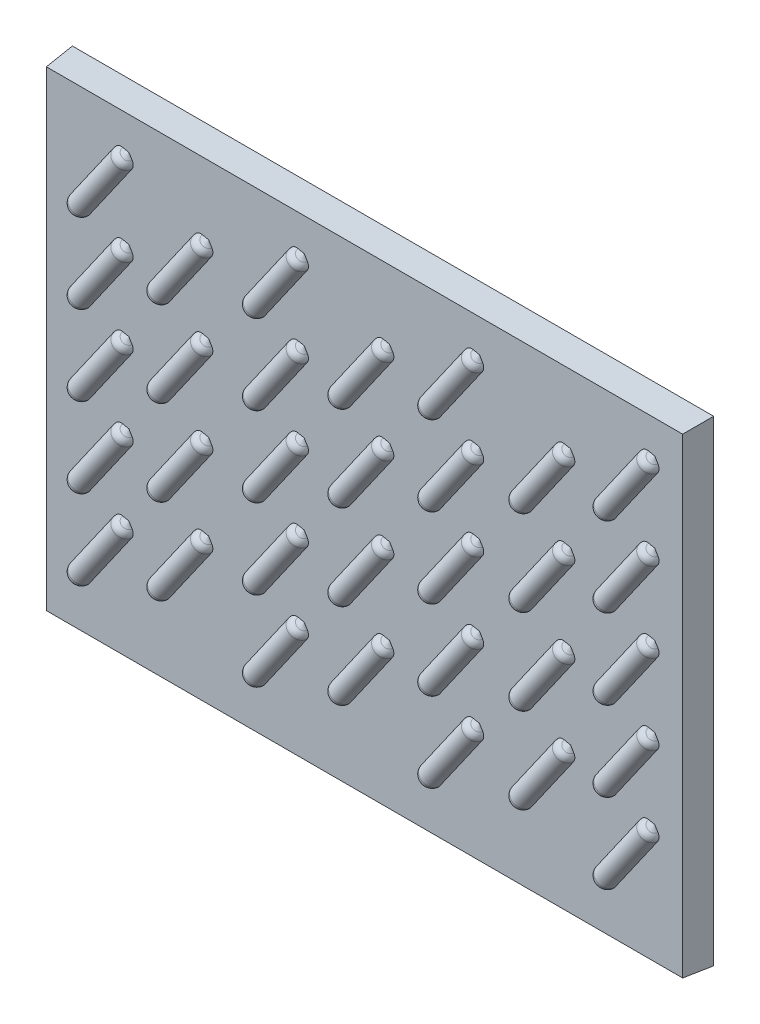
from build123d import *

# Parameters (mm, degrees)
ESQUISSE1_W                = 45
ESQUISSE1_H                = 33.4
BOSS_EXTRU_1_DEPTH         = 2
R_P_TITION_LIN_AIRE2_COUNT = 5
R_P_TITION_LIN_AIRE2_PITCH = 5.6
R_P_TITION_LIN_AIRE3_COUNT = 4
R_P_TITION_LIN_AIRE3_PITCH = 12.3
R_P_TITION_LIN_AIRE4_COUNT = 4
R_P_TITION_LIN_AIRE4_PITCH = 6
R_P_TITION_LIN_AIRE5_COUNT = 3
R_P_TITION_LIN_AIRE5_PITCH = 12.7
D_POUILLE1_ANGLE           = -5


with BuildPart() as part:
    # Esquisse1 → Boss.-Extru.1 (new body)
    with BuildSketch(Plane.XY):
        Rectangle(ESQUISSE1_W, ESQUISSE1_H)
    extrude(amount=BOSS_EXTRU_1_DEPTH)

    # Esquisse8 → R_volution4 (revolve)
    with BuildSketch(Plane(origin=(-7.251293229, 5.077410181, 0), x_dir=(0, 0, 1), z_dir=(-0.8191520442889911, 0.5735764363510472, 0))):
        with BuildLine():
            Line((2, -22.685308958), (2, -16.185308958))
            Line((2, -16.185308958), (1.603040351, -16.355434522))
            ThreePointArc((1.603040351, -16.355434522), (1.382579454, -16.539761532), (1.3, -16.815007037))
            Line((1.3, -16.815007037), (1.3, -22.055610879))
            ThreePointArc((1.3, -22.055610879), (1.382579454, -22.330856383), (1.603040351, -22.515183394))
            Line((1.603040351, -22.515183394), (2, -22.685308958))
        make_face()
    r_volution4 = revolve(axis=Axis((-20.263051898, -13.505307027, 2), (0.5735764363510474, 0.8191520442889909, 0)))

    # R_p_tition lin_aire2: R_volution4 ×5
    with Locations(*[(0, i * R_P_TITION_LIN_AIRE2_PITCH, 0) for i in range(1, R_P_TITION_LIN_AIRE2_COUNT)]):
        add(r_volution4)

    # R_p_tition lin_aire3: R_volution4 ×4
    with Locations(*[(i * R_P_TITION_LIN_AIRE3_PITCH, 0, 0) for i in range(1, R_P_TITION_LIN_AIRE3_COUNT)]):
        add(r_volution4)

    # R_p_tition lin_aire3 copy 1 sketch → R_p_tition lin_aire3 copy 1 (revolve)
    with BuildSketch(Plane(origin=(5.048706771, 10.677410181, 0), x_dir=(0, 0, 1), z_dir=(-0.8191520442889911, 0.5735764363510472, 0))):
        with BuildLine():
            Line((2, -22.685308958), (2, -16.185308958))
            Line((2, -16.185308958), (1.603040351, -16.355434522))
            ThreePointArc((1.603040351, -16.355434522), (1.382579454, -16.539761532), (1.3, -16.815007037))
            Line((1.3, -16.815007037), (1.3, -22.055610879))
            ThreePointArc((1.3, -22.055610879), (1.382579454, -22.330856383), (1.603040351, -22.515183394))
            Line((1.603040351, -22.515183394), (2, -22.685308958))
        make_face()
    revolve(axis=Axis((-7.963051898, -7.905307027, 2), (0.5735764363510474, 0.8191520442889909, 0)))

    # R_p_tition lin_aire3 copy 2 sketch → R_p_tition lin_aire3 copy 2 (revolve)
    with BuildSketch(Plane(origin=(17.348706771, 10.677410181, 0), x_dir=(0, 0, 1), z_dir=(-0.8191520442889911, 0.5735764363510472, 0))):
        with BuildLine():
            Line((2, -22.685308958), (2, -16.185308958))
            Line((2, -16.185308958), (1.603040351, -16.355434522))
            ThreePointArc((1.603040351, -16.355434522), (1.382579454, -16.539761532), (1.3, -16.815007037))
            Line((1.3, -16.815007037), (1.3, -22.055610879))
            ThreePointArc((1.3, -22.055610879), (1.382579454, -22.330856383), (1.603040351, -22.515183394))
            Line((1.603040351, -22.515183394), (2, -22.685308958))
        make_face()
    revolve(axis=Axis((4.336948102, -7.905307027, 2), (0.5735764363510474, 0.8191520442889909, 0)))

    # R_p_tition lin_aire3 copy 3 sketch → R_p_tition lin_aire3 copy 3 (revolve)
    with BuildSketch(Plane(origin=(29.648706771, 10.677410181, 0), x_dir=(0, 0, 1), z_dir=(-0.8191520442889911, 0.5735764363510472, 0))):
        with BuildLine():
            Line((2, -22.685308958), (2, -16.185308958))
            Line((2, -16.185308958), (1.603040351, -16.355434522))
            ThreePointArc((1.603040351, -16.355434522), (1.382579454, -16.539761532), (1.3, -16.815007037))
            Line((1.3, -16.815007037), (1.3, -22.055610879))
            ThreePointArc((1.3, -22.055610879), (1.382579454, -22.330856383), (1.603040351, -22.515183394))
            Line((1.603040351, -22.515183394), (2, -22.685308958))
        make_face()
    revolve(axis=Axis((16.636948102, -7.905307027, 2), (0.5735764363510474, 0.8191520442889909, 0)))

    # R_p_tition lin_aire3 copy 4 sketch → R_p_tition lin_aire3 copy 4 (revolve)
    with BuildSketch(Plane(origin=(5.048706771, 16.277410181, 0), x_dir=(0, 0, 1), z_dir=(-0.8191520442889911, 0.5735764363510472, 0))):
        with BuildLine():
            Line((2, -22.685308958), (2, -16.185308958))
            Line((2, -16.185308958), (1.603040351, -16.355434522))
            ThreePointArc((1.603040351, -16.355434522), (1.382579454, -16.539761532), (1.3, -16.815007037))
            Line((1.3, -16.815007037), (1.3, -22.055610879))
            ThreePointArc((1.3, -22.055610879), (1.382579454, -22.330856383), (1.603040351, -22.515183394))
            Line((1.603040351, -22.515183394), (2, -22.685308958))
        make_face()
    revolve(axis=Axis((-7.963051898, -2.305307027, 2), (0.5735764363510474, 0.8191520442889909, 0)))

    # R_p_tition lin_aire3 copy 5 sketch → R_p_tition lin_aire3 copy 5 (revolve)
    with BuildSketch(Plane(origin=(17.348706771, 16.277410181, 0), x_dir=(0, 0, 1), z_dir=(-0.8191520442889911, 0.5735764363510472, 0))):
        with BuildLine():
            Line((2, -22.685308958), (2, -16.185308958))
            Line((2, -16.185308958), (1.603040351, -16.355434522))
            ThreePointArc((1.603040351, -16.355434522), (1.382579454, -16.539761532), (1.3, -16.815007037))
            Line((1.3, -16.815007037), (1.3, -22.055610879))
            ThreePointArc((1.3, -22.055610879), (1.382579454, -22.330856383), (1.603040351, -22.515183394))
            Line((1.603040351, -22.515183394), (2, -22.685308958))
        make_face()
    revolve(axis=Axis((4.336948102, -2.305307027, 2), (0.5735764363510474, 0.8191520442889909, 0)))

    # R_p_tition lin_aire3 copy 6 sketch → R_p_tition lin_aire3 copy 6 (revolve)
    with BuildSketch(Plane(origin=(29.648706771, 16.277410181, 0), x_dir=(0, 0, 1), z_dir=(-0.8191520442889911, 0.5735764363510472, 0))):
        with BuildLine():
            Line((2, -22.685308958), (2, -16.185308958))
            Line((2, -16.185308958), (1.603040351, -16.355434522))
            ThreePointArc((1.603040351, -16.355434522), (1.382579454, -16.539761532), (1.3, -16.815007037))
            Line((1.3, -16.815007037), (1.3, -22.055610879))
            ThreePointArc((1.3, -22.055610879), (1.382579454, -22.330856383), (1.603040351, -22.515183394))
            Line((1.603040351, -22.515183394), (2, -22.685308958))
        make_face()
    revolve(axis=Axis((16.636948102, -2.305307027, 2), (0.5735764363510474, 0.8191520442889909, 0)))

    # R_p_tition lin_aire3 copy 7 sketch → R_p_tition lin_aire3 copy 7 (revolve)
    with BuildSketch(Plane(origin=(5.048706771, 21.877410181, 0), x_dir=(0, 0, 1), z_dir=(-0.8191520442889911, 0.5735764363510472, 0))):
        with BuildLine():
            Line((2, -22.685308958), (2, -16.185308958))
            Line((2, -16.185308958), (1.603040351, -16.355434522))
            ThreePointArc((1.603040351, -16.355434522), (1.382579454, -16.539761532), (1.3, -16.815007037))
            Line((1.3, -16.815007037), (1.3, -22.055610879))
            ThreePointArc((1.3, -22.055610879), (1.382579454, -22.330856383), (1.603040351, -22.515183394))
            Line((1.603040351, -22.515183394), (2, -22.685308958))
        make_face()
    revolve(axis=Axis((-7.963051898, 3.294692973, 2), (0.5735764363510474, 0.8191520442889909, 0)))

    # R_p_tition lin_aire3 copy 8 sketch → R_p_tition lin_aire3 copy 8 (revolve)
    with BuildSketch(Plane(origin=(17.348706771, 21.877410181, 0), x_dir=(0, 0, 1), z_dir=(-0.8191520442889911, 0.5735764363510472, 0))):
        with BuildLine():
            Line((2, -22.685308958), (2, -16.185308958))
            Line((2, -16.185308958), (1.603040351, -16.355434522))
            ThreePointArc((1.603040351, -16.355434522), (1.382579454, -16.539761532), (1.3, -16.815007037))
            Line((1.3, -16.815007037), (1.3, -22.055610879))
            ThreePointArc((1.3, -22.055610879), (1.382579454, -22.330856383), (1.603040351, -22.515183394))
            Line((1.603040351, -22.515183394), (2, -22.685308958))
        make_face()
    revolve(axis=Axis((4.336948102, 3.294692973, 2), (0.5735764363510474, 0.8191520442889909, 0)))

    # R_p_tition lin_aire3 copy 9 sketch → R_p_tition lin_aire3 copy 9 (revolve)
    with BuildSketch(Plane(origin=(29.648706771, 21.877410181, 0), x_dir=(0, 0, 1), z_dir=(-0.8191520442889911, 0.5735764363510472, 0))):
        with BuildLine():
            Line((2, -22.685308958), (2, -16.185308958))
            Line((2, -16.185308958), (1.603040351, -16.355434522))
            ThreePointArc((1.603040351, -16.355434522), (1.382579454, -16.539761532), (1.3, -16.815007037))
            Line((1.3, -16.815007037), (1.3, -22.055610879))
            ThreePointArc((1.3, -22.055610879), (1.382579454, -22.330856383), (1.603040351, -22.515183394))
            Line((1.603040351, -22.515183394), (2, -22.685308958))
        make_face()
    revolve(axis=Axis((16.636948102, 3.294692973, 2), (0.5735764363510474, 0.8191520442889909, 0)))

    # R_p_tition lin_aire3 copy 10 sketch → R_p_tition lin_aire3 copy 10 (revolve)
    with BuildSketch(Plane(origin=(5.048706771, 27.477410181, 0), x_dir=(0, 0, 1), z_dir=(-0.8191520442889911, 0.5735764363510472, 0))):
        with BuildLine():
            Line((2, -22.685308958), (2, -16.185308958))
            Line((2, -16.185308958), (1.603040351, -16.355434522))
            ThreePointArc((1.603040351, -16.355434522), (1.382579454, -16.539761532), (1.3, -16.815007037))
            Line((1.3, -16.815007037), (1.3, -22.055610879))
            ThreePointArc((1.3, -22.055610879), (1.382579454, -22.330856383), (1.603040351, -22.515183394))
            Line((1.603040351, -22.515183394), (2, -22.685308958))
        make_face()
    revolve(axis=Axis((-7.963051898, 8.894692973, 2), (0.5735764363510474, 0.8191520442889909, 0)))

    # R_p_tition lin_aire3 copy 11 sketch → R_p_tition lin_aire3 copy 11 (revolve)
    with BuildSketch(Plane(origin=(17.348706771, 27.477410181, 0), x_dir=(0, 0, 1), z_dir=(-0.8191520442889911, 0.5735764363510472, 0))):
        with BuildLine():
            Line((2, -22.685308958), (2, -16.185308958))
            Line((2, -16.185308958), (1.603040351, -16.355434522))
            ThreePointArc((1.603040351, -16.355434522), (1.382579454, -16.539761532), (1.3, -16.815007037))
            Line((1.3, -16.815007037), (1.3, -22.055610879))
            ThreePointArc((1.3, -22.055610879), (1.382579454, -22.330856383), (1.603040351, -22.515183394))
            Line((1.603040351, -22.515183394), (2, -22.685308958))
        make_face()
    revolve(axis=Axis((4.336948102, 8.894692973, 2), (0.5735764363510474, 0.8191520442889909, 0)))

    # R_p_tition lin_aire3 copy 12 sketch → R_p_tition lin_aire3 copy 12 (revolve)
    with BuildSketch(Plane(origin=(29.648706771, 27.477410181, 0), x_dir=(0, 0, 1), z_dir=(-0.8191520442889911, 0.5735764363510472, 0))):
        with BuildLine():
            Line((2, -22.685308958), (2, -16.185308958))
            Line((2, -16.185308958), (1.603040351, -16.355434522))
            ThreePointArc((1.603040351, -16.355434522), (1.382579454, -16.539761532), (1.3, -16.815007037))
            Line((1.3, -16.815007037), (1.3, -22.055610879))
            ThreePointArc((1.3, -22.055610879), (1.382579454, -22.330856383), (1.603040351, -22.515183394))
            Line((1.603040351, -22.515183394), (2, -22.685308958))
        make_face()
    revolve(axis=Axis((16.636948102, 8.894692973, 2), (0.5735764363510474, 0.8191520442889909, 0)))

    # Esquisse11 → R_volution5 (revolve)
    with BuildSketch(Plane(origin=(-4.384261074, 3.069892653, 0), x_dir=(0, 0, 1), z_dir=(-0.8191520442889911, 0.5735764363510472, 0))):
        with BuildLine():
            Line((2, -17.934582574), (2, -11.434582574))
            Line((2, -11.434582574), (1.603040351, -11.604708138))
            ThreePointArc((1.603040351, -11.604708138), (1.382579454, -11.789035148), (1.3, -12.064280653))
            Line((1.3, -12.064280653), (1.3, -17.304884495))
            ThreePointArc((1.3, -17.304884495), (1.382579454, -17.580129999), (1.603040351, -17.76445701))
            Line((1.603040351, -17.76445701), (2, -17.934582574))
        make_face()
    r_volution5 = revolve(axis=Axis((-14.671115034, -11.621257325, 2), (0.5735764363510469, 0.8191520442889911, 0)))

    # R_p_tition lin_aire4: R_volution5 ×4
    with Locations(*[(0, i * R_P_TITION_LIN_AIRE4_PITCH, 0) for i in range(1, R_P_TITION_LIN_AIRE4_COUNT)]):
        add(r_volution5)

    # R_p_tition lin_aire5: R_volution5 ×3
    with Locations(*[(i * R_P_TITION_LIN_AIRE5_PITCH, 0, 0) for i in range(1, R_P_TITION_LIN_AIRE5_COUNT)]):
        add(r_volution5)

    # R_p_tition lin_aire5 copy 1 sketch → R_p_tition lin_aire5 copy 1 (revolve)
    with BuildSketch(Plane(origin=(8.315738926, 9.069892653, 0), x_dir=(0, 0, 1), z_dir=(-0.8191520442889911, 0.5735764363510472, 0))):
        with BuildLine():
            Line((2, -17.934582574), (2, -11.434582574))
            Line((2, -11.434582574), (1.603040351, -11.604708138))
            ThreePointArc((1.603040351, -11.604708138), (1.382579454, -11.789035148), (1.3, -12.064280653))
            Line((1.3, -12.064280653), (1.3, -17.304884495))
            ThreePointArc((1.3, -17.304884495), (1.382579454, -17.580129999), (1.603040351, -17.76445701))
            Line((1.603040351, -17.76445701), (2, -17.934582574))
        make_face()
    revolve(axis=Axis((-1.971115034, -5.621257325, 2), (0.5735764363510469, 0.8191520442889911, 0)))

    # R_p_tition lin_aire5 copy 2 sketch → R_p_tition lin_aire5 copy 2 (revolve)
    with BuildSketch(Plane(origin=(21.015738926, 9.069892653, 0), x_dir=(0, 0, 1), z_dir=(-0.8191520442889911, 0.5735764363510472, 0))):
        with BuildLine():
            Line((2, -17.934582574), (2, -11.434582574))
            Line((2, -11.434582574), (1.603040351, -11.604708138))
            ThreePointArc((1.603040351, -11.604708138), (1.382579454, -11.789035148), (1.3, -12.064280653))
            Line((1.3, -12.064280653), (1.3, -17.304884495))
            ThreePointArc((1.3, -17.304884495), (1.382579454, -17.580129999), (1.603040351, -17.76445701))
            Line((1.603040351, -17.76445701), (2, -17.934582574))
        make_face()
    revolve(axis=Axis((10.728884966, -5.621257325, 2), (0.5735764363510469, 0.8191520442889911, 0)))

    # R_p_tition lin_aire5 copy 3 sketch → R_p_tition lin_aire5 copy 3 (revolve)
    with BuildSketch(Plane(origin=(8.315738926, 15.069892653, 0), x_dir=(0, 0, 1), z_dir=(-0.8191520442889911, 0.5735764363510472, 0))):
        with BuildLine():
            Line((2, -17.934582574), (2, -11.434582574))
            Line((2, -11.434582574), (1.603040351, -11.604708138))
            ThreePointArc((1.603040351, -11.604708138), (1.382579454, -11.789035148), (1.3, -12.064280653))
            Line((1.3, -12.064280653), (1.3, -17.304884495))
            ThreePointArc((1.3, -17.304884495), (1.382579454, -17.580129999), (1.603040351, -17.76445701))
            Line((1.603040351, -17.76445701), (2, -17.934582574))
        make_face()
    revolve(axis=Axis((-1.971115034, 0.378742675, 2), (0.5735764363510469, 0.8191520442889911, 0)))

    # R_p_tition lin_aire5 copy 4 sketch → R_p_tition lin_aire5 copy 4 (revolve)
    with BuildSketch(Plane(origin=(21.015738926, 15.069892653, 0), x_dir=(0, 0, 1), z_dir=(-0.8191520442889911, 0.5735764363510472, 0))):
        with BuildLine():
            Line((2, -17.934582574), (2, -11.434582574))
            Line((2, -11.434582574), (1.603040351, -11.604708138))
            ThreePointArc((1.603040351, -11.604708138), (1.382579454, -11.789035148), (1.3, -12.064280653))
            Line((1.3, -12.064280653), (1.3, -17.304884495))
            ThreePointArc((1.3, -17.304884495), (1.382579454, -17.580129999), (1.603040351, -17.76445701))
            Line((1.603040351, -17.76445701), (2, -17.934582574))
        make_face()
    revolve(axis=Axis((10.728884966, 0.378742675, 2), (0.5735764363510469, 0.8191520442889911, 0)))

    # R_p_tition lin_aire5 copy 5 sketch → R_p_tition lin_aire5 copy 5 (revolve)
    with BuildSketch(Plane(origin=(8.315738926, 21.069892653, 0), x_dir=(0, 0, 1), z_dir=(-0.8191520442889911, 0.5735764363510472, 0))):
        with BuildLine():
            Line((2, -17.934582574), (2, -11.434582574))
            Line((2, -11.434582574), (1.603040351, -11.604708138))
            ThreePointArc((1.603040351, -11.604708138), (1.382579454, -11.789035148), (1.3, -12.064280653))
            Line((1.3, -12.064280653), (1.3, -17.304884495))
            ThreePointArc((1.3, -17.304884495), (1.382579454, -17.580129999), (1.603040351, -17.76445701))
            Line((1.603040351, -17.76445701), (2, -17.934582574))
        make_face()
    revolve(axis=Axis((-1.971115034, 6.378742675, 2), (0.5735764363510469, 0.8191520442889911, 0)))

    # R_p_tition lin_aire5 copy 6 sketch → R_p_tition lin_aire5 copy 6 (revolve)
    with BuildSketch(Plane(origin=(21.015738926, 21.069892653, 0), x_dir=(0, 0, 1), z_dir=(-0.8191520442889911, 0.5735764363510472, 0))):
        with BuildLine():
            Line((2, -17.934582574), (2, -11.434582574))
            Line((2, -11.434582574), (1.603040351, -11.604708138))
            ThreePointArc((1.603040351, -11.604708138), (1.382579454, -11.789035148), (1.3, -12.064280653))
            Line((1.3, -12.064280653), (1.3, -17.304884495))
            ThreePointArc((1.3, -17.304884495), (1.382579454, -17.580129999), (1.603040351, -17.76445701))
            Line((1.603040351, -17.76445701), (2, -17.934582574))
        make_face()
    revolve(axis=Axis((10.728884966, 6.378742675, 2), (0.5735764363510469, 0.8191520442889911, 0)))

    # D_pouille1
    d_pouille1_faces = [part.faces().sort_by_distance(p)[0] for p in [
        (0, -16.7, 1),
        (-22.5, 0, 1),
        (22.5, 0, 1),
        (0, 16.7, 1),
    ]]
    draft(d_pouille1_faces, Plane(origin=(0, 0, 0), x_dir=(-1, 0, 0), z_dir=(0, 0, -1)), D_POUILLE1_ANGLE)


solid = part.part
